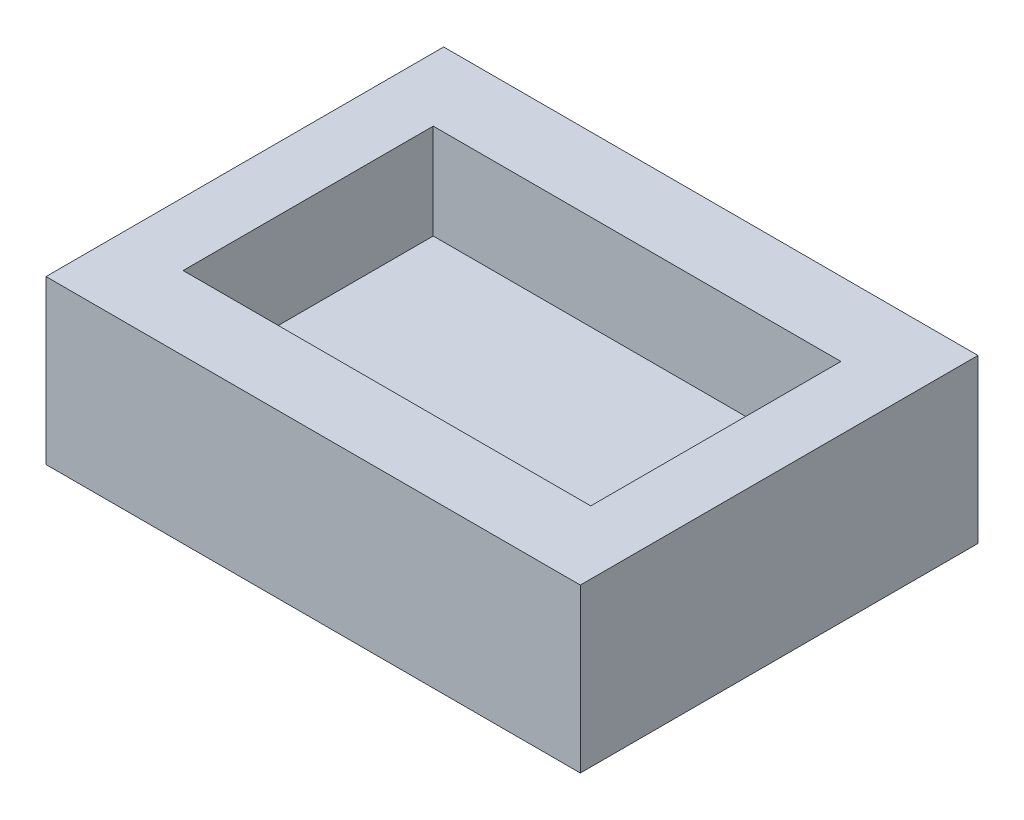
ISO-10303-21;
HEADER;
FILE_DESCRIPTION(('STEP AP214'),'2;1');
FILE_NAME('part.step','',(''),(''),'','','');
FILE_SCHEMA(('AUTOMOTIVE_DESIGN { 1 0 10303 214 1 1 1 1 }'));
ENDSEC;
DATA;
#1=APPLICATION_CONTEXT('core data for automotive mechanical design processes');
#2=APPLICATION_PROTOCOL_DEFINITION('international standard','automotive_design',2000,#1);
#3=PRODUCT_CONTEXT('',#1,'mechanical');
#4=PRODUCT('Part','Part','',(#3));
#5=PRODUCT_RELATED_PRODUCT_CATEGORY('part','',(#4));
#6=PRODUCT_DEFINITION_FORMATION('','',#4);
#7=PRODUCT_DEFINITION_CONTEXT('part definition',#1,'design');
#8=PRODUCT_DEFINITION('design','',#6,#7);
#9=PRODUCT_DEFINITION_SHAPE('','',#8);
#10=(LENGTH_UNIT() NAMED_UNIT(*) SI_UNIT(.MILLI.,.METRE.));
#11=(NAMED_UNIT(*) PLANE_ANGLE_UNIT() SI_UNIT($,.RADIAN.));
#12=(NAMED_UNIT(*) SI_UNIT($,.STERADIAN.) SOLID_ANGLE_UNIT());
#13=UNCERTAINTY_MEASURE_WITH_UNIT(LENGTH_MEASURE(1.E-05),#10,'distance_accuracy_value','');
#14=(GEOMETRIC_REPRESENTATION_CONTEXT(3) GLOBAL_UNCERTAINTY_ASSIGNED_CONTEXT((#13)) GLOBAL_UNIT_ASSIGNED_CONTEXT((#10,
#11,#12)) REPRESENTATION_CONTEXT('',''));
#15=CARTESIAN_POINT('',(0.,0.,0.));
#16=DIRECTION('',(0.,0.,1.));
#17=DIRECTION('',(1.,0.,0.));
#18=AXIS2_PLACEMENT_3D('',#15,#16,#17);
#19=CARTESIAN_POINT('',(-81.2783018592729,49.53,-60.4905334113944));
#20=DIRECTION('',(1.,0.,0.));
#21=DIRECTION('',(0.,0.,-1.));
#22=AXIS2_PLACEMENT_3D('',#19,#20,#21);
#23=PLANE('',#22);
#24=DIRECTION('',(0.,0.,1.));
#25=VECTOR('',#24,1.);
#26=CARTESIAN_POINT('',(-81.2783018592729,0.,-60.4905334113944));
#27=LINE('',#26,#25);
#28=CARTESIAN_POINT('',(-81.2783018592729,0.,-60.4905334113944));
#29=VERTEX_POINT('',#28);
#30=CARTESIAN_POINT('',(-81.2783018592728,0.,60.4905334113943));
#31=VERTEX_POINT('',#30);
#32=EDGE_CURVE('E139',#29,#31,#27,.T.);
#33=ORIENTED_EDGE('',*,*,#32,.T.);
#34=DIRECTION('',(0.,-1.,0.));
#35=VECTOR('',#34,1.);
#36=CARTESIAN_POINT('',(-81.2783018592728,49.53,60.4905334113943));
#37=LINE('',#36,#35);
#38=CARTESIAN_POINT('',(-81.2783018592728,49.53,60.4905334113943));
#39=VERTEX_POINT('',#38);
#40=EDGE_CURVE('E11',#39,#31,#37,.T.);
#41=ORIENTED_EDGE('',*,*,#40,.F.);
#42=DIRECTION('',(0.,0.,1.));
#43=VECTOR('',#42,1.);
#44=CARTESIAN_POINT('',(-81.2783018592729,49.53,-60.4905334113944));
#45=LINE('',#44,#43);
#46=CARTESIAN_POINT('',(-81.2783018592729,49.53,-60.4905334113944));
#47=VERTEX_POINT('',#46);
#48=EDGE_CURVE('E143',#47,#39,#45,.T.);
#49=ORIENTED_EDGE('',*,*,#48,.F.);
#50=DIRECTION('',(0.,-1.,0.));
#51=VECTOR('',#50,1.);
#52=CARTESIAN_POINT('',(-81.2783018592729,49.53,-60.4905334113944));
#53=LINE('',#52,#51);
#54=EDGE_CURVE('E149',#47,#29,#53,.T.);
#55=ORIENTED_EDGE('',*,*,#54,.T.);
#56=EDGE_LOOP('',(#33,#41,#49,#55));
#57=FACE_BOUND('',#56,.T.);
#58=ADVANCED_FACE('F31',(#57),#23,.F.);
#59=CARTESIAN_POINT('',(-81.2783018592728,49.53,60.4905334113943));
#60=DIRECTION('',(0.,0.,-1.));
#61=DIRECTION('',(-1.,0.,0.));
#62=AXIS2_PLACEMENT_3D('',#59,#60,#61);
#63=PLANE('',#62);
#64=DIRECTION('',(1.,0.,0.));
#65=VECTOR('',#64,1.);
#66=CARTESIAN_POINT('',(-81.2783018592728,0.,60.4905334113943));
#67=LINE('',#66,#65);
#68=CARTESIAN_POINT('',(81.2783018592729,0.,60.4905334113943));
#69=VERTEX_POINT('',#68);
#70=EDGE_CURVE('E152',#31,#69,#67,.T.);
#71=ORIENTED_EDGE('',*,*,#70,.T.);
#72=DIRECTION('',(0.,-1.,0.));
#73=VECTOR('',#72,1.);
#74=CARTESIAN_POINT('',(81.2783018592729,49.53,60.4905334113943));
#75=LINE('',#74,#73);
#76=CARTESIAN_POINT('',(81.2783018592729,49.53,60.4905334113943));
#77=VERTEX_POINT('',#76);
#78=EDGE_CURVE('E38',#77,#69,#75,.T.);
#79=ORIENTED_EDGE('',*,*,#78,.F.);
#80=DIRECTION('',(1.,0.,0.));
#81=VECTOR('',#80,1.);
#82=CARTESIAN_POINT('',(-81.2783018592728,49.53,60.4905334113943));
#83=LINE('',#82,#81);
#84=EDGE_CURVE('E82',#39,#77,#83,.T.);
#85=ORIENTED_EDGE('',*,*,#84,.F.);
#86=ORIENTED_EDGE('',*,*,#40,.T.);
#87=EDGE_LOOP('',(#71,#79,#85,#86));
#88=FACE_BOUND('',#87,.T.);
#89=ADVANCED_FACE('F181',(#88),#63,.F.);
#90=CARTESIAN_POINT('',(81.2783018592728,49.53,-60.4905334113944));
#91=DIRECTION('',(-1.,0.,0.));
#92=DIRECTION('',(0.,0.,1.));
#93=AXIS2_PLACEMENT_3D('',#90,#91,#92);
#94=PLANE('',#93);
#95=DIRECTION('',(0.,0.,-1.));
#96=VECTOR('',#95,1.);
#97=CARTESIAN_POINT('',(81.2783018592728,0.,-60.4905334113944));
#98=LINE('',#97,#96);
#99=CARTESIAN_POINT('',(81.2783018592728,0.,-60.4905334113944));
#100=VERTEX_POINT('',#99);
#101=EDGE_CURVE('E154',#69,#100,#98,.T.);
#102=ORIENTED_EDGE('',*,*,#101,.T.);
#103=DIRECTION('',(0.,-1.,0.));
#104=VECTOR('',#103,1.);
#105=CARTESIAN_POINT('',(81.2783018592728,49.53,-60.4905334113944));
#106=LINE('',#105,#104);
#107=CARTESIAN_POINT('',(81.2783018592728,49.53,-60.4905334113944));
#108=VERTEX_POINT('',#107);
#109=EDGE_CURVE('E158',#108,#100,#106,.T.);
#110=ORIENTED_EDGE('',*,*,#109,.F.);
#111=DIRECTION('',(0.,0.,-1.));
#112=VECTOR('',#111,1.);
#113=CARTESIAN_POINT('',(81.2783018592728,49.53,-60.4905334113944));
#114=LINE('',#113,#112);
#115=EDGE_CURVE('E146',#77,#108,#114,.T.);
#116=ORIENTED_EDGE('',*,*,#115,.F.);
#117=ORIENTED_EDGE('',*,*,#78,.T.);
#118=EDGE_LOOP('',(#102,#110,#116,#117));
#119=FACE_BOUND('',#118,.T.);
#120=ADVANCED_FACE('F163',(#119),#94,.F.);
#121=CARTESIAN_POINT('',(-81.2783018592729,49.53,-60.4905334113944));
#122=DIRECTION('',(0.,0.,1.));
#123=DIRECTION('',(1.,0.,0.));
#124=AXIS2_PLACEMENT_3D('',#121,#122,#123);
#125=PLANE('',#124);
#126=DIRECTION('',(-1.,0.,0.));
#127=VECTOR('',#126,1.);
#128=CARTESIAN_POINT('',(-81.2783018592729,0.,-60.4905334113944));
#129=LINE('',#128,#127);
#130=EDGE_CURVE('E75',#100,#29,#129,.T.);
#131=ORIENTED_EDGE('',*,*,#130,.T.);
#132=ORIENTED_EDGE('',*,*,#54,.F.);
#133=DIRECTION('',(-1.,0.,0.));
#134=VECTOR('',#133,1.);
#135=CARTESIAN_POINT('',(-81.2783018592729,49.53,-60.4905334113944));
#136=LINE('',#135,#134);
#137=EDGE_CURVE('E54',#108,#47,#136,.T.);
#138=ORIENTED_EDGE('',*,*,#137,.F.);
#139=ORIENTED_EDGE('',*,*,#109,.T.);
#140=EDGE_LOOP('',(#131,#132,#138,#139));
#141=FACE_BOUND('',#140,.T.);
#142=ADVANCED_FACE('F171',(#141),#125,.F.);
#143=CARTESIAN_POINT('',(-81.2783018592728,49.53,60.4905334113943));
#144=DIRECTION('',(0.,1.,0.));
#145=DIRECTION('',(0.,0.,1.));
#146=AXIS2_PLACEMENT_3D('',#143,#144,#145);
#147=PLANE('',#146);
#148=DIRECTION('',(0.,0.,1.));
#149=VECTOR('',#148,1.);
#150=CARTESIAN_POINT('',(-62.0119306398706,49.53,-38.0512866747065));
#151=LINE('',#150,#149);
#152=CARTESIAN_POINT('',(-62.0119306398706,49.53,-38.0512866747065));
#153=VERTEX_POINT('',#152);
#154=CARTESIAN_POINT('',(-62.0119306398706,49.53,38.0512866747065));
#155=VERTEX_POINT('',#154);
#156=EDGE_CURVE('E45',#153,#155,#151,.T.);
#157=ORIENTED_EDGE('',*,*,#156,.F.);
#158=DIRECTION('',(-1.,0.,0.));
#159=VECTOR('',#158,1.);
#160=CARTESIAN_POINT('',(-62.0119306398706,49.53,-38.0512866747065));
#161=LINE('',#160,#159);
#162=CARTESIAN_POINT('',(62.0119306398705,49.53,-38.0512866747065));
#163=VERTEX_POINT('',#162);
#164=EDGE_CURVE('E124',#163,#153,#161,.T.);
#165=ORIENTED_EDGE('',*,*,#164,.F.);
#166=DIRECTION('',(0.,0.,-1.));
#167=VECTOR('',#166,1.);
#168=CARTESIAN_POINT('',(62.0119306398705,49.53,-38.0512866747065));
#169=LINE('',#168,#167);
#170=CARTESIAN_POINT('',(62.0119306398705,49.53,38.0512866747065));
#171=VERTEX_POINT('',#170);
#172=EDGE_CURVE('E127',#171,#163,#169,.T.);
#173=ORIENTED_EDGE('',*,*,#172,.F.);
#174=DIRECTION('',(1.,0.,0.));
#175=VECTOR('',#174,1.);
#176=CARTESIAN_POINT('',(-62.0119306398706,49.53,38.0512866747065));
#177=LINE('',#176,#175);
#178=EDGE_CURVE('E133',#155,#171,#177,.T.);
#179=ORIENTED_EDGE('',*,*,#178,.F.);
#180=EDGE_LOOP('',(#157,#165,#173,#179));
#181=FACE_BOUND('',#180,.T.);
#182=ORIENTED_EDGE('',*,*,#48,.T.);
#183=ORIENTED_EDGE('',*,*,#84,.T.);
#184=ORIENTED_EDGE('',*,*,#115,.T.);
#185=ORIENTED_EDGE('',*,*,#137,.T.);
#186=EDGE_LOOP('',(#182,#183,#184,#185));
#187=FACE_BOUND('',#186,.T.);
#188=ADVANCED_FACE('F173',(#181,#187),#147,.T.);
#189=CARTESIAN_POINT('',(-81.2783018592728,0.,60.4905334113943));
#190=DIRECTION('',(0.,1.,0.));
#191=DIRECTION('',(0.,0.,1.));
#192=AXIS2_PLACEMENT_3D('',#189,#190,#191);
#193=PLANE('',#192);
#194=ORIENTED_EDGE('',*,*,#32,.F.);
#195=ORIENTED_EDGE('',*,*,#130,.F.);
#196=ORIENTED_EDGE('',*,*,#101,.F.);
#197=ORIENTED_EDGE('',*,*,#70,.F.);
#198=EDGE_LOOP('',(#194,#195,#196,#197));
#199=FACE_BOUND('',#198,.T.);
#200=ADVANCED_FACE('F167',(#199),#193,.F.);
#201=CARTESIAN_POINT('',(-62.0119306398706,20.574,-38.0512866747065));
#202=DIRECTION('',(-1.,0.,0.));
#203=DIRECTION('',(0.,0.,1.));
#204=AXIS2_PLACEMENT_3D('',#201,#202,#203);
#205=PLANE('',#204);
#206=ORIENTED_EDGE('',*,*,#156,.T.);
#207=DIRECTION('',(0.,1.,0.));
#208=VECTOR('',#207,1.);
#209=CARTESIAN_POINT('',(-62.0119306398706,20.574,38.0512866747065));
#210=LINE('',#209,#208);
#211=CARTESIAN_POINT('',(-62.0119306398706,20.574,38.0512866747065));
#212=VERTEX_POINT('',#211);
#213=EDGE_CURVE('E102',#212,#155,#210,.T.);
#214=ORIENTED_EDGE('',*,*,#213,.F.);
#215=DIRECTION('',(0.,0.,1.));
#216=VECTOR('',#215,1.);
#217=CARTESIAN_POINT('',(-62.0119306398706,20.574,-38.0512866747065));
#218=LINE('',#217,#216);
#219=CARTESIAN_POINT('',(-62.0119306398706,20.574,-38.0512866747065));
#220=VERTEX_POINT('',#219);
#221=EDGE_CURVE('E106',#220,#212,#218,.T.);
#222=ORIENTED_EDGE('',*,*,#221,.F.);
#223=DIRECTION('',(0.,1.,0.));
#224=VECTOR('',#223,1.);
#225=CARTESIAN_POINT('',(-62.0119306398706,20.574,-38.0512866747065));
#226=LINE('',#225,#224);
#227=EDGE_CURVE('E137',#220,#153,#226,.T.);
#228=ORIENTED_EDGE('',*,*,#227,.T.);
#229=EDGE_LOOP('',(#206,#214,#222,#228));
#230=FACE_BOUND('',#229,.T.);
#231=ADVANCED_FACE('F104',(#230),#205,.F.);
#232=CARTESIAN_POINT('',(-62.0119306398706,20.574,-38.0512866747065));
#233=DIRECTION('',(0.,0.,-1.));
#234=DIRECTION('',(-1.,0.,0.));
#235=AXIS2_PLACEMENT_3D('',#232,#233,#234);
#236=PLANE('',#235);
#237=ORIENTED_EDGE('',*,*,#164,.T.);
#238=ORIENTED_EDGE('',*,*,#227,.F.);
#239=DIRECTION('',(-1.,0.,0.));
#240=VECTOR('',#239,1.);
#241=CARTESIAN_POINT('',(-62.0119306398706,20.574,-38.0512866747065));
#242=LINE('',#241,#240);
#243=CARTESIAN_POINT('',(62.0119306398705,20.574,-38.0512866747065));
#244=VERTEX_POINT('',#243);
#245=EDGE_CURVE('E112',#244,#220,#242,.T.);
#246=ORIENTED_EDGE('',*,*,#245,.F.);
#247=DIRECTION('',(0.,1.,0.));
#248=VECTOR('',#247,1.);
#249=CARTESIAN_POINT('',(62.0119306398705,20.574,-38.0512866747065));
#250=LINE('',#249,#248);
#251=EDGE_CURVE('E140',#244,#163,#250,.T.);
#252=ORIENTED_EDGE('',*,*,#251,.T.);
#253=EDGE_LOOP('',(#237,#238,#246,#252));
#254=FACE_BOUND('',#253,.T.);
#255=ADVANCED_FACE('F220',(#254),#236,.F.);
#256=CARTESIAN_POINT('',(62.0119306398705,20.574,-38.0512866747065));
#257=DIRECTION('',(1.,0.,0.));
#258=DIRECTION('',(0.,0.,-1.));
#259=AXIS2_PLACEMENT_3D('',#256,#257,#258);
#260=PLANE('',#259);
#261=ORIENTED_EDGE('',*,*,#172,.T.);
#262=ORIENTED_EDGE('',*,*,#251,.F.);
#263=DIRECTION('',(0.,0.,-1.));
#264=VECTOR('',#263,1.);
#265=CARTESIAN_POINT('',(62.0119306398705,20.574,-38.0512866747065));
#266=LINE('',#265,#264);
#267=CARTESIAN_POINT('',(62.0119306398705,20.574,38.0512866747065));
#268=VERTEX_POINT('',#267);
#269=EDGE_CURVE('E120',#268,#244,#266,.T.);
#270=ORIENTED_EDGE('',*,*,#269,.F.);
#271=DIRECTION('',(0.,1.,0.));
#272=VECTOR('',#271,1.);
#273=CARTESIAN_POINT('',(62.0119306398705,20.574,38.0512866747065));
#274=LINE('',#273,#272);
#275=EDGE_CURVE('E111',#268,#171,#274,.T.);
#276=ORIENTED_EDGE('',*,*,#275,.T.);
#277=EDGE_LOOP('',(#261,#262,#270,#276));
#278=FACE_BOUND('',#277,.T.);
#279=ADVANCED_FACE('F229',(#278),#260,.F.);
#280=CARTESIAN_POINT('',(-62.0119306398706,20.574,38.0512866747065));
#281=DIRECTION('',(0.,0.,1.));
#282=DIRECTION('',(1.,0.,0.));
#283=AXIS2_PLACEMENT_3D('',#280,#281,#282);
#284=PLANE('',#283);
#285=ORIENTED_EDGE('',*,*,#178,.T.);
#286=ORIENTED_EDGE('',*,*,#275,.F.);
#287=DIRECTION('',(1.,0.,0.));
#288=VECTOR('',#287,1.);
#289=CARTESIAN_POINT('',(-62.0119306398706,20.574,38.0512866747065));
#290=LINE('',#289,#288);
#291=EDGE_CURVE('E115',#212,#268,#290,.T.);
#292=ORIENTED_EDGE('',*,*,#291,.F.);
#293=ORIENTED_EDGE('',*,*,#213,.T.);
#294=EDGE_LOOP('',(#285,#286,#292,#293));
#295=FACE_BOUND('',#294,.T.);
#296=ADVANCED_FACE('F116',(#295),#284,.F.);
#297=CARTESIAN_POINT('',(-62.0119306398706,20.574,38.0512866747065));
#298=DIRECTION('',(0.,1.,0.));
#299=DIRECTION('',(0.,0.,1.));
#300=AXIS2_PLACEMENT_3D('',#297,#298,#299);
#301=PLANE('',#300);
#302=ORIENTED_EDGE('',*,*,#221,.T.);
#303=ORIENTED_EDGE('',*,*,#291,.T.);
#304=ORIENTED_EDGE('',*,*,#269,.T.);
#305=ORIENTED_EDGE('',*,*,#245,.T.);
#306=EDGE_LOOP('',(#302,#303,#304,#305));
#307=FACE_BOUND('',#306,.T.);
#308=ADVANCED_FACE('F122',(#307),#301,.T.);
#309=CLOSED_SHELL('',(#58,#89,#120,#142,#188,#200,#231,#255,#279,#296,#308));
#310=MANIFOLD_SOLID_BREP('B2',#309);
#311=ADVANCED_BREP_SHAPE_REPRESENTATION('',(#18,#310),#14);
#312=SHAPE_DEFINITION_REPRESENTATION(#9,#311);
ENDSEC;
END-ISO-10303-21;
